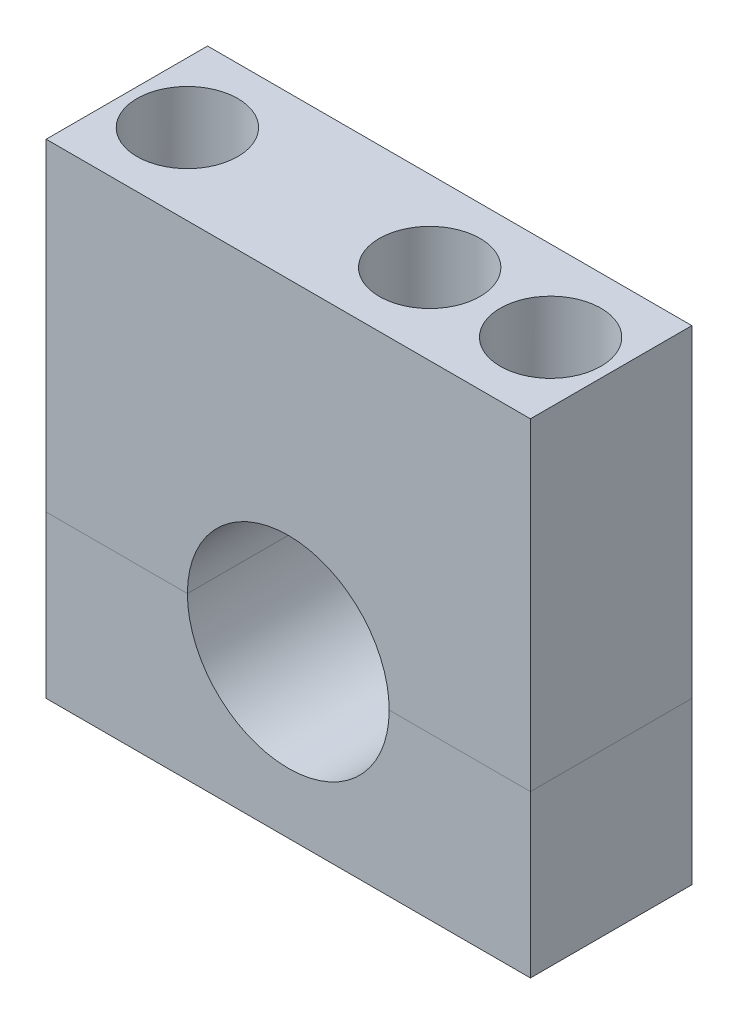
ISO-10303-21;
HEADER;
FILE_DESCRIPTION(('STEP AP214'),'2;1');
FILE_NAME('part.step','',(''),(''),'','','');
FILE_SCHEMA(('AUTOMOTIVE_DESIGN { 1 0 10303 214 1 1 1 1 }'));
ENDSEC;
DATA;
#1=APPLICATION_CONTEXT('core data for automotive mechanical design processes');
#2=APPLICATION_PROTOCOL_DEFINITION('international standard','automotive_design',2000,#1);
#3=PRODUCT_CONTEXT('',#1,'mechanical');
#4=PRODUCT('Part','Part','',(#3));
#5=PRODUCT_RELATED_PRODUCT_CATEGORY('part','',(#4));
#6=PRODUCT_DEFINITION_FORMATION('','',#4);
#7=PRODUCT_DEFINITION_CONTEXT('part definition',#1,'design');
#8=PRODUCT_DEFINITION('design','',#6,#7);
#9=PRODUCT_DEFINITION_SHAPE('','',#8);
#10=(LENGTH_UNIT() NAMED_UNIT(*) SI_UNIT(.MILLI.,.METRE.));
#11=(NAMED_UNIT(*) PLANE_ANGLE_UNIT() SI_UNIT($,.RADIAN.));
#12=(NAMED_UNIT(*) SI_UNIT($,.STERADIAN.) SOLID_ANGLE_UNIT());
#13=UNCERTAINTY_MEASURE_WITH_UNIT(LENGTH_MEASURE(1.E-05),#10,'distance_accuracy_value','');
#14=(GEOMETRIC_REPRESENTATION_CONTEXT(3) GLOBAL_UNCERTAINTY_ASSIGNED_CONTEXT((#13)) GLOBAL_UNIT_ASSIGNED_CONTEXT((#10,
#11,#12)) REPRESENTATION_CONTEXT('',''));
#15=CARTESIAN_POINT('',(0.,0.,0.));
#16=DIRECTION('',(0.,0.,1.));
#17=DIRECTION('',(1.,0.,0.));
#18=AXIS2_PLACEMENT_3D('',#15,#16,#17);
#19=CARTESIAN_POINT('',(19.05,-12.7,6.35));
#20=DIRECTION('',(0.,1.,0.));
#21=DIRECTION('',(0.,0.,1.));
#22=AXIS2_PLACEMENT_3D('',#19,#20,#21);
#23=PLANE('',#22);
#24=CARTESIAN_POINT('',(14.2875,-12.7,0.));
#25=DIRECTION('',(0.,1.,0.));
#26=DIRECTION('',(0.,0.,1.));
#27=AXIS2_PLACEMENT_3D('',#24,#25,#26);
#28=CIRCLE('',#27,2.3876);
#29=CARTESIAN_POINT('',(14.2875,-12.7,2.3876));
#30=VERTEX_POINT('',#29);
#31=EDGE_CURVE('E135',#30,#30,#28,.F.);
#32=ORIENTED_EDGE('',*,*,#31,.F.);
#33=EDGE_LOOP('',(#32));
#34=FACE_BOUND('',#33,.T.);
#35=DIRECTION('',(1.,0.,0.));
#36=VECTOR('',#35,1.);
#37=CARTESIAN_POINT('',(19.05,-12.7,-6.35));
#38=LINE('',#37,#36);
#39=CARTESIAN_POINT('',(-19.05,-12.7,-6.35));
#40=VERTEX_POINT('',#39);
#41=CARTESIAN_POINT('',(19.05,-12.7,-6.35));
#42=VERTEX_POINT('',#41);
#43=EDGE_CURVE('E134',#40,#42,#38,.T.);
#44=ORIENTED_EDGE('',*,*,#43,.T.);
#45=DIRECTION('',(0.,0.,-1.));
#46=VECTOR('',#45,1.);
#47=CARTESIAN_POINT('',(19.05,-12.7,6.35));
#48=LINE('',#47,#46);
#49=CARTESIAN_POINT('',(19.05,-12.7,6.35));
#50=VERTEX_POINT('',#49);
#51=EDGE_CURVE('E53',#50,#42,#48,.T.);
#52=ORIENTED_EDGE('',*,*,#51,.F.);
#53=DIRECTION('',(1.,0.,0.));
#54=VECTOR('',#53,1.);
#55=CARTESIAN_POINT('',(19.05,-12.7,6.35));
#56=LINE('',#55,#54);
#57=CARTESIAN_POINT('',(-19.05,-12.7,6.35));
#58=VERTEX_POINT('',#57);
#59=EDGE_CURVE('E99',#58,#50,#56,.T.);
#60=ORIENTED_EDGE('',*,*,#59,.F.);
#61=DIRECTION('',(0.,0.,-1.));
#62=VECTOR('',#61,1.);
#63=CARTESIAN_POINT('',(-19.05,-12.7,6.35));
#64=LINE('',#63,#62);
#65=EDGE_CURVE('E12',#58,#40,#64,.T.);
#66=ORIENTED_EDGE('',*,*,#65,.T.);
#67=EDGE_LOOP('',(#44,#52,#60,#66));
#68=FACE_BOUND('',#67,.T.);
#69=CARTESIAN_POINT('',(-14.2875,-12.7,0.));
#70=DIRECTION('',(0.,1.,0.));
#71=DIRECTION('',(0.,0.,1.));
#72=AXIS2_PLACEMENT_3D('',#69,#70,#71);
#73=CIRCLE('',#72,2.3876);
#74=CARTESIAN_POINT('',(-14.2875,-12.7,2.3876));
#75=VERTEX_POINT('',#74);
#76=EDGE_CURVE('E149',#75,#75,#73,.F.);
#77=ORIENTED_EDGE('',*,*,#76,.F.);
#78=EDGE_LOOP('',(#77));
#79=FACE_BOUND('',#78,.T.);
#80=ADVANCED_FACE('F43',(#34,#68,#79),#23,.F.);
#81=CARTESIAN_POINT('',(7.9375,0.,6.35));
#82=DIRECTION('',(0.,-1.,0.));
#83=DIRECTION('',(1.,0.,0.));
#84=AXIS2_PLACEMENT_3D('',#81,#82,#83);
#85=PLANE('',#84);
#86=DIRECTION('',(-1.,0.,0.));
#87=VECTOR('',#86,1.);
#88=CARTESIAN_POINT('',(7.9375,0.,-6.35));
#89=LINE('',#88,#87);
#90=CARTESIAN_POINT('',(19.05,0.,-6.35));
#91=VERTEX_POINT('',#90);
#92=CARTESIAN_POINT('',(7.9375,0.,-6.35));
#93=VERTEX_POINT('',#92);
#94=EDGE_CURVE('E121',#91,#93,#89,.T.);
#95=ORIENTED_EDGE('',*,*,#94,.T.);
#96=DIRECTION('',(0.,0.,-1.));
#97=VECTOR('',#96,1.);
#98=CARTESIAN_POINT('',(7.9375,0.,6.35));
#99=LINE('',#98,#97);
#100=CARTESIAN_POINT('',(7.9375,0.,6.35));
#101=VERTEX_POINT('',#100);
#102=EDGE_CURVE('E117',#101,#93,#99,.T.);
#103=ORIENTED_EDGE('',*,*,#102,.F.);
#104=DIRECTION('',(-1.,0.,0.));
#105=VECTOR('',#104,1.);
#106=CARTESIAN_POINT('',(7.9375,0.,6.35));
#107=LINE('',#106,#105);
#108=CARTESIAN_POINT('',(19.05,0.,6.35));
#109=VERTEX_POINT('',#108);
#110=EDGE_CURVE('E106',#109,#101,#107,.T.);
#111=ORIENTED_EDGE('',*,*,#110,.F.);
#112=DIRECTION('',(0.,0.,-1.));
#113=VECTOR('',#112,1.);
#114=CARTESIAN_POINT('',(19.05,0.,6.35));
#115=LINE('',#114,#113);
#116=EDGE_CURVE('E122',#109,#91,#115,.T.);
#117=ORIENTED_EDGE('',*,*,#116,.T.);
#118=EDGE_LOOP('',(#95,#103,#111,#117));
#119=FACE_BOUND('',#118,.T.);
#120=CARTESIAN_POINT('',(14.2875,0.,0.));
#121=DIRECTION('',(0.,-1.,0.));
#122=DIRECTION('',(1.,0.,0.));
#123=AXIS2_PLACEMENT_3D('',#120,#121,#122);
#124=CIRCLE('',#123,2.3876);
#125=CARTESIAN_POINT('',(16.6751,0.,0.));
#126=VERTEX_POINT('',#125);
#127=EDGE_CURVE('E47',#126,#126,#124,.F.);
#128=ORIENTED_EDGE('',*,*,#127,.F.);
#129=EDGE_LOOP('',(#128));
#130=FACE_BOUND('',#129,.T.);
#131=ADVANCED_FACE('F118',(#119,#130),#85,.F.);
#132=CARTESIAN_POINT('',(-19.05,0.,6.35));
#133=DIRECTION('',(0.,-1.,0.));
#134=DIRECTION('',(1.,0.,0.));
#135=AXIS2_PLACEMENT_3D('',#132,#133,#134);
#136=PLANE('',#135);
#137=DIRECTION('',(-1.,0.,0.));
#138=VECTOR('',#137,1.);
#139=CARTESIAN_POINT('',(-19.05,0.,-6.35));
#140=LINE('',#139,#138);
#141=CARTESIAN_POINT('',(-7.9375,0.,-6.35));
#142=VERTEX_POINT('',#141);
#143=CARTESIAN_POINT('',(-19.05,0.,-6.35));
#144=VERTEX_POINT('',#143);
#145=EDGE_CURVE('E91',#142,#144,#140,.T.);
#146=ORIENTED_EDGE('',*,*,#145,.T.);
#147=DIRECTION('',(0.,0.,-1.));
#148=VECTOR('',#147,1.);
#149=CARTESIAN_POINT('',(-19.05,0.,6.35));
#150=LINE('',#149,#148);
#151=CARTESIAN_POINT('',(-19.05,0.,6.35));
#152=VERTEX_POINT('',#151);
#153=EDGE_CURVE('E127',#152,#144,#150,.T.);
#154=ORIENTED_EDGE('',*,*,#153,.F.);
#155=DIRECTION('',(-1.,0.,0.));
#156=VECTOR('',#155,1.);
#157=CARTESIAN_POINT('',(-19.05,0.,6.35));
#158=LINE('',#157,#156);
#159=CARTESIAN_POINT('',(-7.9375,0.,6.35));
#160=VERTEX_POINT('',#159);
#161=EDGE_CURVE('E62',#160,#152,#158,.T.);
#162=ORIENTED_EDGE('',*,*,#161,.F.);
#163=DIRECTION('',(0.,0.,-1.));
#164=VECTOR('',#163,1.);
#165=CARTESIAN_POINT('',(-7.9375,0.,6.35));
#166=LINE('',#165,#164);
#167=EDGE_CURVE('E123',#160,#142,#166,.T.);
#168=ORIENTED_EDGE('',*,*,#167,.T.);
#169=EDGE_LOOP('',(#146,#154,#162,#168));
#170=FACE_BOUND('',#169,.T.);
#171=CARTESIAN_POINT('',(-14.2875,0.,0.));
#172=DIRECTION('',(0.,-1.,0.));
#173=DIRECTION('',(1.,0.,0.));
#174=AXIS2_PLACEMENT_3D('',#171,#172,#173);
#175=CIRCLE('',#174,2.3876);
#176=CARTESIAN_POINT('',(-11.8999,0.,0.));
#177=VERTEX_POINT('',#176);
#178=EDGE_CURVE('E147',#177,#177,#175,.F.);
#179=ORIENTED_EDGE('',*,*,#178,.F.);
#180=EDGE_LOOP('',(#179));
#181=FACE_BOUND('',#180,.T.);
#182=ADVANCED_FACE('F171',(#170,#181),#136,.F.);
#183=CARTESIAN_POINT('',(-19.05,-12.7,6.35));
#184=DIRECTION('',(1.,0.,0.));
#185=DIRECTION('',(0.,1.,0.));
#186=AXIS2_PLACEMENT_3D('',#183,#184,#185);
#187=PLANE('',#186);
#188=DIRECTION('',(0.,-1.,0.));
#189=VECTOR('',#188,1.);
#190=CARTESIAN_POINT('',(-19.05,-12.7,-6.35));
#191=LINE('',#190,#189);
#192=EDGE_CURVE('E131',#144,#40,#191,.T.);
#193=ORIENTED_EDGE('',*,*,#192,.T.);
#194=ORIENTED_EDGE('',*,*,#65,.F.);
#195=DIRECTION('',(0.,-1.,0.));
#196=VECTOR('',#195,1.);
#197=CARTESIAN_POINT('',(-19.05,-12.7,6.35));
#198=LINE('',#197,#196);
#199=EDGE_CURVE('E142',#152,#58,#198,.T.);
#200=ORIENTED_EDGE('',*,*,#199,.F.);
#201=ORIENTED_EDGE('',*,*,#153,.T.);
#202=EDGE_LOOP('',(#193,#194,#200,#201));
#203=FACE_BOUND('',#202,.T.);
#204=ADVANCED_FACE('F45',(#203),#187,.F.);
#205=CARTESIAN_POINT('',(19.05,0.,6.35));
#206=DIRECTION('',(-1.,0.,0.));
#207=DIRECTION('',(0.,-1.,0.));
#208=AXIS2_PLACEMENT_3D('',#205,#206,#207);
#209=PLANE('',#208);
#210=DIRECTION('',(0.,1.,0.));
#211=VECTOR('',#210,1.);
#212=CARTESIAN_POINT('',(19.05,0.,-6.35));
#213=LINE('',#212,#211);
#214=EDGE_CURVE('E137',#42,#91,#213,.T.);
#215=ORIENTED_EDGE('',*,*,#214,.T.);
#216=ORIENTED_EDGE('',*,*,#116,.F.);
#217=DIRECTION('',(0.,1.,0.));
#218=VECTOR('',#217,1.);
#219=CARTESIAN_POINT('',(19.05,0.,6.35));
#220=LINE('',#219,#218);
#221=EDGE_CURVE('E112',#50,#109,#220,.T.);
#222=ORIENTED_EDGE('',*,*,#221,.F.);
#223=ORIENTED_EDGE('',*,*,#51,.T.);
#224=EDGE_LOOP('',(#215,#216,#222,#223));
#225=FACE_BOUND('',#224,.T.);
#226=ADVANCED_FACE('F166',(#225),#209,.F.);
#227=CARTESIAN_POINT('',(0.,0.,6.35));
#228=DIRECTION('',(0.,0.,-1.));
#229=DIRECTION('',(-1.,0.,0.));
#230=AXIS2_PLACEMENT_3D('',#227,#228,#229);
#231=CYLINDRICAL_SURFACE('',#230,7.9375);
#232=CARTESIAN_POINT('',(0.,0.,-6.35));
#233=DIRECTION('',(0.,0.,-1.));
#234=DIRECTION('',(1.,0.,0.));
#235=AXIS2_PLACEMENT_3D('',#232,#233,#234);
#236=CIRCLE('',#235,7.9375);
#237=EDGE_CURVE('E85',#93,#142,#236,.T.);
#238=ORIENTED_EDGE('',*,*,#237,.T.);
#239=ORIENTED_EDGE('',*,*,#167,.F.);
#240=CARTESIAN_POINT('',(0.,0.,6.35));
#241=DIRECTION('',(0.,0.,-1.));
#242=DIRECTION('',(1.,0.,0.));
#243=AXIS2_PLACEMENT_3D('',#240,#241,#242);
#244=CIRCLE('',#243,7.9375);
#245=EDGE_CURVE('E110',#101,#160,#244,.T.);
#246=ORIENTED_EDGE('',*,*,#245,.F.);
#247=ORIENTED_EDGE('',*,*,#102,.T.);
#248=EDGE_LOOP('',(#238,#239,#246,#247));
#249=FACE_BOUND('',#248,.T.);
#250=ADVANCED_FACE('F125',(#249),#231,.F.);
#251=CARTESIAN_POINT('',(0.,0.,6.35));
#252=DIRECTION('',(0.,0.,1.));
#253=DIRECTION('',(1.,0.,0.));
#254=AXIS2_PLACEMENT_3D('',#251,#252,#253);
#255=PLANE('',#254);
#256=ORIENTED_EDGE('',*,*,#199,.T.);
#257=ORIENTED_EDGE('',*,*,#59,.T.);
#258=ORIENTED_EDGE('',*,*,#221,.T.);
#259=ORIENTED_EDGE('',*,*,#110,.T.);
#260=ORIENTED_EDGE('',*,*,#245,.T.);
#261=ORIENTED_EDGE('',*,*,#161,.T.);
#262=EDGE_LOOP('',(#256,#257,#258,#259,#260,#261));
#263=FACE_BOUND('',#262,.T.);
#264=ADVANCED_FACE('F108',(#263),#255,.T.);
#265=CARTESIAN_POINT('',(0.,0.,-6.35));
#266=DIRECTION('',(0.,0.,1.));
#267=DIRECTION('',(1.,0.,0.));
#268=AXIS2_PLACEMENT_3D('',#265,#266,#267);
#269=PLANE('',#268);
#270=ORIENTED_EDGE('',*,*,#192,.F.);
#271=ORIENTED_EDGE('',*,*,#145,.F.);
#272=ORIENTED_EDGE('',*,*,#237,.F.);
#273=ORIENTED_EDGE('',*,*,#94,.F.);
#274=ORIENTED_EDGE('',*,*,#214,.F.);
#275=ORIENTED_EDGE('',*,*,#43,.F.);
#276=EDGE_LOOP('',(#270,#271,#272,#273,#274,#275));
#277=FACE_BOUND('',#276,.T.);
#278=ADVANCED_FACE('F169',(#277),#269,.F.);
#279=CARTESIAN_POINT('',(-14.2875,50.8,0.));
#280=DIRECTION('',(0.,-1.,0.));
#281=DIRECTION('',(0.,0.,-1.));
#282=AXIS2_PLACEMENT_3D('',#279,#280,#281);
#283=CYLINDRICAL_SURFACE('',#282,2.3876);
#284=ORIENTED_EDGE('',*,*,#178,.T.);
#285=EDGE_LOOP('',(#284));
#286=FACE_BOUND('',#285,.T.);
#287=ORIENTED_EDGE('',*,*,#76,.T.);
#288=EDGE_LOOP('',(#287));
#289=FACE_BOUND('',#288,.T.);
#290=ADVANCED_FACE('F197',(#286,#289),#283,.F.);
#291=CARTESIAN_POINT('',(14.2875,50.8,0.));
#292=DIRECTION('',(0.,-1.,0.));
#293=DIRECTION('',(0.,0.,-1.));
#294=AXIS2_PLACEMENT_3D('',#291,#292,#293);
#295=CYLINDRICAL_SURFACE('',#294,2.3876);
#296=ORIENTED_EDGE('',*,*,#127,.T.);
#297=EDGE_LOOP('',(#296));
#298=FACE_BOUND('',#297,.T.);
#299=ORIENTED_EDGE('',*,*,#31,.T.);
#300=EDGE_LOOP('',(#299));
#301=FACE_BOUND('',#300,.T.);
#302=ADVANCED_FACE('F199',(#298,#301),#295,.F.);
#303=CLOSED_SHELL('',(#80,#131,#182,#204,#226,#250,#264,#278,#290,#302));
#304=MANIFOLD_SOLID_BREP('B2',#303);
#305=CARTESIAN_POINT('',(19.05,25.4,6.35));
#306=DIRECTION('',(0.,-1.,0.));
#307=DIRECTION('',(1.,0.,0.));
#308=AXIS2_PLACEMENT_3D('',#305,#306,#307);
#309=PLANE('',#308);
#310=CARTESIAN_POINT('',(4.7752,25.4,0.));
#311=DIRECTION('',(0.,1.,0.));
#312=DIRECTION('',(-1.,0.,0.));
#313=AXIS2_PLACEMENT_3D('',#310,#311,#312);
#314=CIRCLE('',#313,3.9624);
#315=CARTESIAN_POINT('',(0.812800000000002,25.4,0.));
#316=VERTEX_POINT('',#315);
#317=EDGE_CURVE('E385',#316,#316,#314,.T.);
#318=ORIENTED_EDGE('',*,*,#317,.F.);
#319=EDGE_LOOP('',(#318));
#320=FACE_BOUND('',#319,.T.);
#321=CARTESIAN_POINT('',(-14.2875,25.4,0.));
#322=DIRECTION('',(0.,-1.,0.));
#323=DIRECTION('',(1.,0.,0.));
#324=AXIS2_PLACEMENT_3D('',#321,#322,#323);
#325=CIRCLE('',#324,3.9624);
#326=CARTESIAN_POINT('',(-10.3251,25.4,0.));
#327=VERTEX_POINT('',#326);
#328=EDGE_CURVE('E369',#327,#327,#325,.F.);
#329=ORIENTED_EDGE('',*,*,#328,.F.);
#330=EDGE_LOOP('',(#329));
#331=FACE_BOUND('',#330,.T.);
#332=DIRECTION('',(-1.,0.,0.));
#333=VECTOR('',#332,1.);
#334=CARTESIAN_POINT('',(19.05,25.4,-6.35));
#335=LINE('',#334,#333);
#336=CARTESIAN_POINT('',(19.05,25.4,-6.35));
#337=VERTEX_POINT('',#336);
#338=CARTESIAN_POINT('',(-19.05,25.4,-6.35));
#339=VERTEX_POINT('',#338);
#340=EDGE_CURVE('E309',#337,#339,#335,.T.);
#341=ORIENTED_EDGE('',*,*,#340,.T.);
#342=DIRECTION('',(0.,0.,-1.));
#343=VECTOR('',#342,1.);
#344=CARTESIAN_POINT('',(-19.05,25.4,6.35));
#345=LINE('',#344,#343);
#346=CARTESIAN_POINT('',(-19.05,25.4,6.35));
#347=VERTEX_POINT('',#346);
#348=EDGE_CURVE('E345',#347,#339,#345,.T.);
#349=ORIENTED_EDGE('',*,*,#348,.F.);
#350=DIRECTION('',(-1.,0.,0.));
#351=VECTOR('',#350,1.);
#352=CARTESIAN_POINT('',(19.05,25.4,6.35));
#353=LINE('',#352,#351);
#354=CARTESIAN_POINT('',(19.05,25.4,6.35));
#355=VERTEX_POINT('',#354);
#356=EDGE_CURVE('E280',#355,#347,#353,.T.);
#357=ORIENTED_EDGE('',*,*,#356,.F.);
#358=DIRECTION('',(0.,0.,-1.));
#359=VECTOR('',#358,1.);
#360=CARTESIAN_POINT('',(19.05,25.4,6.35));
#361=LINE('',#360,#359);
#362=EDGE_CURVE('E341',#355,#337,#361,.T.);
#363=ORIENTED_EDGE('',*,*,#362,.T.);
#364=EDGE_LOOP('',(#341,#349,#357,#363));
#365=FACE_BOUND('',#364,.T.);
#366=CARTESIAN_POINT('',(14.2875,25.4,0.));
#367=DIRECTION('',(0.,-1.,0.));
#368=DIRECTION('',(1.,0.,0.));
#369=AXIS2_PLACEMENT_3D('',#366,#367,#368);
#370=CIRCLE('',#369,3.9624);
#371=CARTESIAN_POINT('',(18.2499,25.4,0.));
#372=VERTEX_POINT('',#371);
#373=EDGE_CURVE('E265',#372,#372,#370,.F.);
#374=ORIENTED_EDGE('',*,*,#373,.F.);
#375=EDGE_LOOP('',(#374));
#376=FACE_BOUND('',#375,.T.);
#377=ADVANCED_FACE('F261',(#320,#331,#365,#376),#309,.F.);
#378=CARTESIAN_POINT('',(14.2875,50.8,0.));
#379=DIRECTION('',(0.,-1.,0.));
#380=DIRECTION('',(0.,0.,-1.));
#381=AXIS2_PLACEMENT_3D('',#378,#379,#380);
#382=CYLINDRICAL_SURFACE('',#381,2.3876);
#383=CARTESIAN_POINT('',(14.2875,0.,0.));
#384=DIRECTION('',(0.,1.,0.));
#385=DIRECTION('',(-1.,0.,0.));
#386=AXIS2_PLACEMENT_3D('',#383,#384,#385);
#387=CIRCLE('',#386,2.3876);
#388=CARTESIAN_POINT('',(11.8999,0.,0.));
#389=VERTEX_POINT('',#388);
#390=EDGE_CURVE('E372',#389,#389,#387,.F.);
#391=ORIENTED_EDGE('',*,*,#390,.T.);
#392=EDGE_LOOP('',(#391));
#393=FACE_BOUND('',#392,.T.);
#394=CARTESIAN_POINT('',(14.2875,5.08,0.));
#395=DIRECTION('',(0.,1.,0.));
#396=DIRECTION('',(0.,0.,1.));
#397=AXIS2_PLACEMENT_3D('',#394,#395,#396);
#398=CIRCLE('',#397,2.3876);
#399=CARTESIAN_POINT('',(14.2875,5.08,2.3876));
#400=VERTEX_POINT('',#399);
#401=EDGE_CURVE('E373',#400,#400,#398,.T.);
#402=ORIENTED_EDGE('',*,*,#401,.T.);
#403=EDGE_LOOP('',(#402));
#404=FACE_BOUND('',#403,.T.);
#405=ADVANCED_FACE('F409',(#393,#404),#382,.F.);
#406=CARTESIAN_POINT('',(-14.2875,50.8,0.));
#407=DIRECTION('',(0.,-1.,0.));
#408=DIRECTION('',(0.,0.,-1.));
#409=AXIS2_PLACEMENT_3D('',#406,#407,#408);
#410=CYLINDRICAL_SURFACE('',#409,2.3876);
#411=CARTESIAN_POINT('',(-14.2875,0.,0.));
#412=DIRECTION('',(0.,1.,0.));
#413=DIRECTION('',(-1.,0.,0.));
#414=AXIS2_PLACEMENT_3D('',#411,#412,#413);
#415=CIRCLE('',#414,2.3876);
#416=CARTESIAN_POINT('',(-16.6751,0.,0.));
#417=VERTEX_POINT('',#416);
#418=EDGE_CURVE('E353',#417,#417,#415,.F.);
#419=ORIENTED_EDGE('',*,*,#418,.T.);
#420=EDGE_LOOP('',(#419));
#421=FACE_BOUND('',#420,.T.);
#422=CARTESIAN_POINT('',(-14.2875,5.08,0.));
#423=DIRECTION('',(0.,1.,0.));
#424=DIRECTION('',(0.,0.,1.));
#425=AXIS2_PLACEMENT_3D('',#422,#423,#424);
#426=CIRCLE('',#425,2.3876);
#427=CARTESIAN_POINT('',(-14.2875,5.08,2.3876));
#428=VERTEX_POINT('',#427);
#429=EDGE_CURVE('E366',#428,#428,#426,.T.);
#430=ORIENTED_EDGE('',*,*,#429,.T.);
#431=EDGE_LOOP('',(#430));
#432=FACE_BOUND('',#431,.T.);
#433=ADVANCED_FACE('F435',(#421,#432),#410,.F.);
#434=CARTESIAN_POINT('',(-19.05,0.,6.35));
#435=DIRECTION('',(0.,1.,0.));
#436=DIRECTION('',(-1.,0.,0.));
#437=AXIS2_PLACEMENT_3D('',#434,#435,#436);
#438=PLANE('',#437);
#439=DIRECTION('',(1.,0.,0.));
#440=VECTOR('',#439,1.);
#441=CARTESIAN_POINT('',(-19.05,0.,-6.35));
#442=LINE('',#441,#440);
#443=CARTESIAN_POINT('',(-19.05,0.,-6.35));
#444=VERTEX_POINT('',#443);
#445=CARTESIAN_POINT('',(-7.9375,0.,-6.35));
#446=VERTEX_POINT('',#445);
#447=EDGE_CURVE('E352',#444,#446,#442,.T.);
#448=ORIENTED_EDGE('',*,*,#447,.T.);
#449=DIRECTION('',(0.,0.,-1.));
#450=VECTOR('',#449,1.);
#451=CARTESIAN_POINT('',(-7.9375,0.,6.35));
#452=LINE('',#451,#450);
#453=CARTESIAN_POINT('',(-7.9375,0.,6.35));
#454=VERTEX_POINT('',#453);
#455=EDGE_CURVE('E271',#454,#446,#452,.T.);
#456=ORIENTED_EDGE('',*,*,#455,.F.);
#457=DIRECTION('',(1.,0.,0.));
#458=VECTOR('',#457,1.);
#459=CARTESIAN_POINT('',(-19.05,0.,6.35));
#460=LINE('',#459,#458);
#461=CARTESIAN_POINT('',(-19.05,0.,6.35));
#462=VERTEX_POINT('',#461);
#463=EDGE_CURVE('E317',#462,#454,#460,.T.);
#464=ORIENTED_EDGE('',*,*,#463,.F.);
#465=DIRECTION('',(0.,0.,-1.));
#466=VECTOR('',#465,1.);
#467=CARTESIAN_POINT('',(-19.05,0.,6.35));
#468=LINE('',#467,#466);
#469=EDGE_CURVE('E41',#462,#444,#468,.T.);
#470=ORIENTED_EDGE('',*,*,#469,.T.);
#471=EDGE_LOOP('',(#448,#456,#464,#470));
#472=FACE_BOUND('',#471,.T.);
#473=ORIENTED_EDGE('',*,*,#418,.F.);
#474=EDGE_LOOP('',(#473));
#475=FACE_BOUND('',#474,.T.);
#476=ADVANCED_FACE('F398',(#472,#475),#438,.F.);
#477=CARTESIAN_POINT('',(7.9375,0.,6.35));
#478=DIRECTION('',(0.,1.,0.));
#479=DIRECTION('',(-1.,0.,0.));
#480=AXIS2_PLACEMENT_3D('',#477,#478,#479);
#481=PLANE('',#480);
#482=DIRECTION('',(1.,0.,0.));
#483=VECTOR('',#482,1.);
#484=CARTESIAN_POINT('',(7.9375,0.,-6.35));
#485=LINE('',#484,#483);
#486=CARTESIAN_POINT('',(7.9375,0.,-6.35));
#487=VERTEX_POINT('',#486);
#488=CARTESIAN_POINT('',(19.05,0.,-6.35));
#489=VERTEX_POINT('',#488);
#490=EDGE_CURVE('E339',#487,#489,#485,.T.);
#491=ORIENTED_EDGE('',*,*,#490,.T.);
#492=DIRECTION('',(0.,0.,-1.));
#493=VECTOR('',#492,1.);
#494=CARTESIAN_POINT('',(19.05,0.,6.35));
#495=LINE('',#494,#493);
#496=CARTESIAN_POINT('',(19.05,0.,6.35));
#497=VERTEX_POINT('',#496);
#498=EDGE_CURVE('E335',#497,#489,#495,.T.);
#499=ORIENTED_EDGE('',*,*,#498,.F.);
#500=DIRECTION('',(1.,0.,0.));
#501=VECTOR('',#500,1.);
#502=CARTESIAN_POINT('',(7.9375,0.,6.35));
#503=LINE('',#502,#501);
#504=CARTESIAN_POINT('',(7.9375,0.,6.35));
#505=VERTEX_POINT('',#504);
#506=EDGE_CURVE('E324',#505,#497,#503,.T.);
#507=ORIENTED_EDGE('',*,*,#506,.F.);
#508=DIRECTION('',(0.,0.,-1.));
#509=VECTOR('',#508,1.);
#510=CARTESIAN_POINT('',(7.9375,0.,6.35));
#511=LINE('',#510,#509);
#512=EDGE_CURVE('E340',#505,#487,#511,.T.);
#513=ORIENTED_EDGE('',*,*,#512,.T.);
#514=EDGE_LOOP('',(#491,#499,#507,#513));
#515=FACE_BOUND('',#514,.T.);
#516=ORIENTED_EDGE('',*,*,#390,.F.);
#517=EDGE_LOOP('',(#516));
#518=FACE_BOUND('',#517,.T.);
#519=ADVANCED_FACE('F336',(#515,#518),#481,.F.);
#520=CARTESIAN_POINT('',(-19.05,25.4,6.35));
#521=DIRECTION('',(1.,0.,0.));
#522=DIRECTION('',(0.,0.,-1.));
#523=AXIS2_PLACEMENT_3D('',#520,#521,#522);
#524=PLANE('',#523);
#525=DIRECTION('',(0.,-1.,0.));
#526=VECTOR('',#525,1.);
#527=CARTESIAN_POINT('',(-19.05,25.4,-6.35));
#528=LINE('',#527,#526);
#529=EDGE_CURVE('E349',#339,#444,#528,.T.);
#530=ORIENTED_EDGE('',*,*,#529,.T.);
#531=ORIENTED_EDGE('',*,*,#469,.F.);
#532=DIRECTION('',(0.,-1.,0.));
#533=VECTOR('',#532,1.);
#534=CARTESIAN_POINT('',(-19.05,25.4,6.35));
#535=LINE('',#534,#533);
#536=EDGE_CURVE('E360',#347,#462,#535,.T.);
#537=ORIENTED_EDGE('',*,*,#536,.F.);
#538=ORIENTED_EDGE('',*,*,#348,.T.);
#539=EDGE_LOOP('',(#530,#531,#537,#538));
#540=FACE_BOUND('',#539,.T.);
#541=ADVANCED_FACE('F263',(#540),#524,.F.);
#542=CARTESIAN_POINT('',(0.,0.,6.35));
#543=DIRECTION('',(0.,0.,-1.));
#544=DIRECTION('',(-1.,0.,0.));
#545=AXIS2_PLACEMENT_3D('',#542,#543,#544);
#546=CYLINDRICAL_SURFACE('',#545,7.9375);
#547=CARTESIAN_POINT('',(0.,0.,-6.35));
#548=DIRECTION('',(0.,0.,-1.));
#549=DIRECTION('',(1.,0.,0.));
#550=AXIS2_PLACEMENT_3D('',#547,#548,#549);
#551=CIRCLE('',#550,7.9375);
#552=EDGE_CURVE('E355',#446,#487,#551,.T.);
#553=ORIENTED_EDGE('',*,*,#552,.T.);
#554=ORIENTED_EDGE('',*,*,#512,.F.);
#555=CARTESIAN_POINT('',(0.,0.,6.35));
#556=DIRECTION('',(0.,0.,-1.));
#557=DIRECTION('',(1.,0.,0.));
#558=AXIS2_PLACEMENT_3D('',#555,#556,#557);
#559=CIRCLE('',#558,7.9375);
#560=EDGE_CURVE('E330',#454,#505,#559,.T.);
#561=ORIENTED_EDGE('',*,*,#560,.F.);
#562=ORIENTED_EDGE('',*,*,#455,.T.);
#563=EDGE_LOOP('',(#553,#554,#561,#562));
#564=FACE_BOUND('',#563,.T.);
#565=ADVANCED_FACE('F402',(#564),#546,.F.);
#566=CARTESIAN_POINT('',(19.05,0.,6.35));
#567=DIRECTION('',(-1.,0.,0.));
#568=DIRECTION('',(0.,0.,1.));
#569=AXIS2_PLACEMENT_3D('',#566,#567,#568);
#570=PLANE('',#569);
#571=DIRECTION('',(0.,1.,0.));
#572=VECTOR('',#571,1.);
#573=CARTESIAN_POINT('',(19.05,0.,-6.35));
#574=LINE('',#573,#572);
#575=EDGE_CURVE('E303',#489,#337,#574,.T.);
#576=ORIENTED_EDGE('',*,*,#575,.T.);
#577=ORIENTED_EDGE('',*,*,#362,.F.);
#578=DIRECTION('',(0.,1.,0.));
#579=VECTOR('',#578,1.);
#580=CARTESIAN_POINT('',(19.05,0.,6.35));
#581=LINE('',#580,#579);
#582=EDGE_CURVE('E328',#497,#355,#581,.T.);
#583=ORIENTED_EDGE('',*,*,#582,.F.);
#584=ORIENTED_EDGE('',*,*,#498,.T.);
#585=EDGE_LOOP('',(#576,#577,#583,#584));
#586=FACE_BOUND('',#585,.T.);
#587=ADVANCED_FACE('F343',(#586),#570,.F.);
#588=CARTESIAN_POINT('',(0.,0.,6.35));
#589=DIRECTION('',(0.,0.,1.));
#590=DIRECTION('',(1.,0.,0.));
#591=AXIS2_PLACEMENT_3D('',#588,#589,#590);
#592=PLANE('',#591);
#593=ORIENTED_EDGE('',*,*,#536,.T.);
#594=ORIENTED_EDGE('',*,*,#463,.T.);
#595=ORIENTED_EDGE('',*,*,#560,.T.);
#596=ORIENTED_EDGE('',*,*,#506,.T.);
#597=ORIENTED_EDGE('',*,*,#582,.T.);
#598=ORIENTED_EDGE('',*,*,#356,.T.);
#599=EDGE_LOOP('',(#593,#594,#595,#596,#597,#598));
#600=FACE_BOUND('',#599,.T.);
#601=ADVANCED_FACE('F326',(#600),#592,.T.);
#602=CARTESIAN_POINT('',(0.,0.,-6.35));
#603=DIRECTION('',(0.,0.,1.));
#604=DIRECTION('',(1.,0.,0.));
#605=AXIS2_PLACEMENT_3D('',#602,#603,#604);
#606=PLANE('',#605);
#607=ORIENTED_EDGE('',*,*,#529,.F.);
#608=ORIENTED_EDGE('',*,*,#340,.F.);
#609=ORIENTED_EDGE('',*,*,#575,.F.);
#610=ORIENTED_EDGE('',*,*,#490,.F.);
#611=ORIENTED_EDGE('',*,*,#552,.F.);
#612=ORIENTED_EDGE('',*,*,#447,.F.);
#613=EDGE_LOOP('',(#607,#608,#609,#610,#611,#612));
#614=FACE_BOUND('',#613,.T.);
#615=ADVANCED_FACE('F405',(#614),#606,.F.);
#616=CARTESIAN_POINT('',(-14.2875,33.02,0.));
#617=DIRECTION('',(0.,-1.,0.));
#618=DIRECTION('',(0.,0.,-1.));
#619=AXIS2_PLACEMENT_3D('',#616,#617,#618);
#620=CYLINDRICAL_SURFACE('',#619,3.9624);
#621=CARTESIAN_POINT('',(-14.2875,5.08,0.));
#622=DIRECTION('',(0.,1.,0.));
#623=DIRECTION('',(0.,0.,1.));
#624=AXIS2_PLACEMENT_3D('',#621,#622,#623);
#625=CIRCLE('',#624,3.9624);
#626=CARTESIAN_POINT('',(-14.2875,5.08,3.9624));
#627=VERTEX_POINT('',#626);
#628=EDGE_CURVE('E370',#627,#627,#625,.T.);
#629=ORIENTED_EDGE('',*,*,#628,.F.);
#630=EDGE_LOOP('',(#629));
#631=FACE_BOUND('',#630,.T.);
#632=ORIENTED_EDGE('',*,*,#328,.T.);
#633=EDGE_LOOP('',(#632));
#634=FACE_BOUND('',#633,.T.);
#635=ADVANCED_FACE('F427',(#631,#634),#620,.F.);
#636=CARTESIAN_POINT('',(-14.2875,5.08,0.));
#637=DIRECTION('',(0.,1.,0.));
#638=DIRECTION('',(0.,0.,1.));
#639=AXIS2_PLACEMENT_3D('',#636,#637,#638);
#640=PLANE('',#639);
#641=ORIENTED_EDGE('',*,*,#429,.F.);
#642=EDGE_LOOP('',(#641));
#643=FACE_BOUND('',#642,.T.);
#644=ORIENTED_EDGE('',*,*,#628,.T.);
#645=EDGE_LOOP('',(#644));
#646=FACE_BOUND('',#645,.T.);
#647=ADVANCED_FACE('F417',(#643,#646),#640,.T.);
#648=CARTESIAN_POINT('',(14.2875,33.02,0.));
#649=DIRECTION('',(0.,-1.,0.));
#650=DIRECTION('',(0.,0.,-1.));
#651=AXIS2_PLACEMENT_3D('',#648,#649,#650);
#652=CYLINDRICAL_SURFACE('',#651,3.9624);
#653=CARTESIAN_POINT('',(14.2875,5.08,0.));
#654=DIRECTION('',(0.,1.,0.));
#655=DIRECTION('',(0.,0.,1.));
#656=AXIS2_PLACEMENT_3D('',#653,#654,#655);
#657=CIRCLE('',#656,3.9624);
#658=CARTESIAN_POINT('',(14.2875,5.08,3.9624));
#659=VERTEX_POINT('',#658);
#660=EDGE_CURVE('E375',#659,#659,#657,.T.);
#661=ORIENTED_EDGE('',*,*,#660,.F.);
#662=EDGE_LOOP('',(#661));
#663=FACE_BOUND('',#662,.T.);
#664=ORIENTED_EDGE('',*,*,#373,.T.);
#665=EDGE_LOOP('',(#664));
#666=FACE_BOUND('',#665,.T.);
#667=ADVANCED_FACE('F414',(#663,#666),#652,.F.);
#668=CARTESIAN_POINT('',(14.2875,5.08,0.));
#669=DIRECTION('',(0.,1.,0.));
#670=DIRECTION('',(0.,0.,1.));
#671=AXIS2_PLACEMENT_3D('',#668,#669,#670);
#672=PLANE('',#671);
#673=ORIENTED_EDGE('',*,*,#401,.F.);
#674=EDGE_LOOP('',(#673));
#675=FACE_BOUND('',#674,.T.);
#676=ORIENTED_EDGE('',*,*,#660,.T.);
#677=EDGE_LOOP('',(#676));
#678=FACE_BOUND('',#677,.T.);
#679=ADVANCED_FACE('F416',(#675,#678),#672,.T.);
#680=CARTESIAN_POINT('',(4.7752,9.525,0.));
#681=DIRECTION('',(0.,1.,0.));
#682=DIRECTION('',(-1.,0.,0.));
#683=AXIS2_PLACEMENT_3D('',#680,#681,#682);
#684=CYLINDRICAL_SURFACE('',#683,3.9624);
#685=CARTESIAN_POINT('',(4.7752,9.525,0.));
#686=DIRECTION('',(0.,1.,0.));
#687=DIRECTION('',(-1.,0.,0.));
#688=AXIS2_PLACEMENT_3D('',#685,#686,#687);
#689=CIRCLE('',#688,3.9624);
#690=CARTESIAN_POINT('',(0.812800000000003,9.525,0.));
#691=VERTEX_POINT('',#690);
#692=EDGE_CURVE('E380',#691,#691,#689,.T.);
#693=ORIENTED_EDGE('',*,*,#692,.F.);
#694=EDGE_LOOP('',(#693));
#695=FACE_BOUND('',#694,.T.);
#696=ORIENTED_EDGE('',*,*,#317,.T.);
#697=EDGE_LOOP('',(#696));
#698=FACE_BOUND('',#697,.T.);
#699=ADVANCED_FACE('F424',(#695,#698),#684,.F.);
#700=CARTESIAN_POINT('',(4.7752,9.525,0.));
#701=DIRECTION('',(0.,1.,0.));
#702=DIRECTION('',(-1.,0.,0.));
#703=AXIS2_PLACEMENT_3D('',#700,#701,#702);
#704=PLANE('',#703);
#705=ORIENTED_EDGE('',*,*,#692,.T.);
#706=EDGE_LOOP('',(#705));
#707=FACE_BOUND('',#706,.T.);
#708=ADVANCED_FACE('F516',(#707),#704,.T.);
#709=CLOSED_SHELL('',(#377,#405,#433,#476,#519,#541,#565,#587,#601,#615,#635,#647,#667,#679,
#699,#708));
#710=MANIFOLD_SOLID_BREP('B6',#709);
#711=ADVANCED_BREP_SHAPE_REPRESENTATION('',(#18,#304,#710),#14);
#712=SHAPE_DEFINITION_REPRESENTATION(#9,#711);
ENDSEC;
END-ISO-10303-21;
